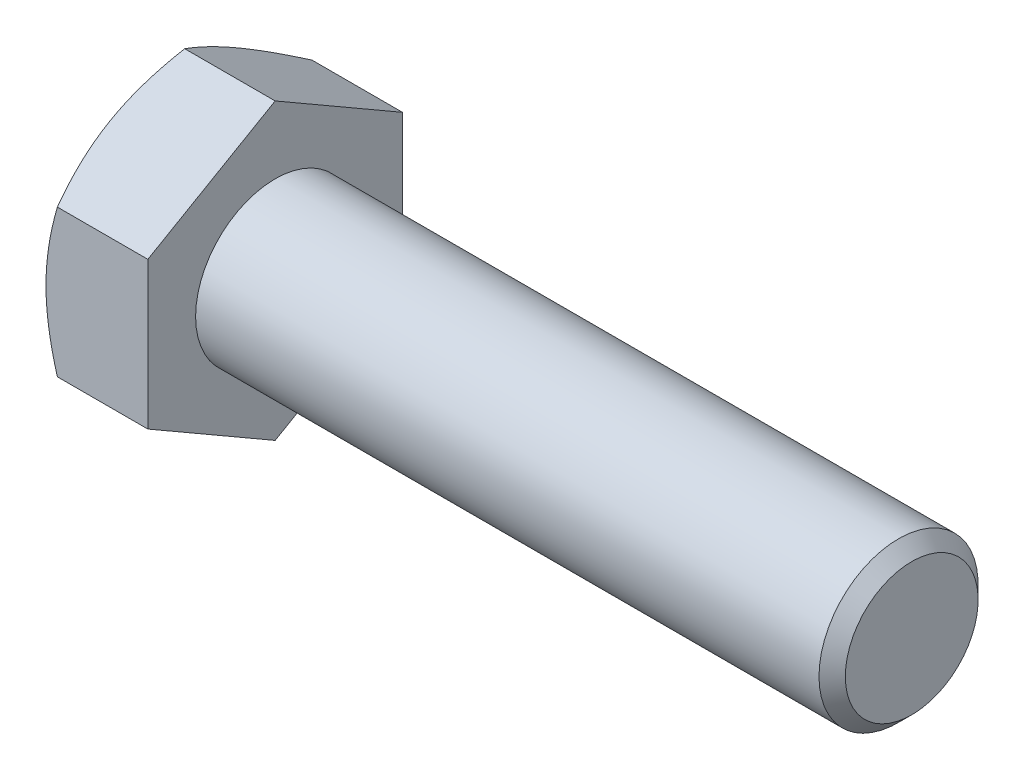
ISO-10303-21;
HEADER;
FILE_DESCRIPTION(('STEP AP214'),'2;1');
FILE_NAME('part.step','',(''),(''),'','','');
FILE_SCHEMA(('AUTOMOTIVE_DESIGN { 1 0 10303 214 1 1 1 1 }'));
ENDSEC;
DATA;
#1=APPLICATION_CONTEXT('core data for automotive mechanical design processes');
#2=APPLICATION_PROTOCOL_DEFINITION('international standard','automotive_design',2000,#1);
#3=PRODUCT_CONTEXT('',#1,'mechanical');
#4=PRODUCT('Part','Part','',(#3));
#5=PRODUCT_RELATED_PRODUCT_CATEGORY('part','',(#4));
#6=PRODUCT_DEFINITION_FORMATION('','',#4);
#7=PRODUCT_DEFINITION_CONTEXT('part definition',#1,'design');
#8=PRODUCT_DEFINITION('design','',#6,#7);
#9=PRODUCT_DEFINITION_SHAPE('','',#8);
#10=(LENGTH_UNIT() NAMED_UNIT(*) SI_UNIT(.MILLI.,.METRE.));
#11=(NAMED_UNIT(*) PLANE_ANGLE_UNIT() SI_UNIT($,.RADIAN.));
#12=(NAMED_UNIT(*) SI_UNIT($,.STERADIAN.) SOLID_ANGLE_UNIT());
#13=UNCERTAINTY_MEASURE_WITH_UNIT(LENGTH_MEASURE(1.E-05),#10,'distance_accuracy_value','');
#14=(GEOMETRIC_REPRESENTATION_CONTEXT(3) GLOBAL_UNCERTAINTY_ASSIGNED_CONTEXT((#13)) GLOBAL_UNIT_ASSIGNED_CONTEXT((#10,
#11,#12)) REPRESENTATION_CONTEXT('',''));
#15=CARTESIAN_POINT('',(0.,0.,0.));
#16=DIRECTION('',(0.,0.,1.));
#17=DIRECTION('',(1.,0.,0.));
#18=AXIS2_PLACEMENT_3D('',#15,#16,#17);
#19=CARTESIAN_POINT('',(6.4,4.618802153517,-8.));
#20=DIRECTION('',(0.,-0.866025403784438,0.500000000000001));
#21=DIRECTION('',(0.,-0.500000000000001,-0.866025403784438));
#22=AXIS2_PLACEMENT_3D('',#19,#20,#21);
#23=PLANE('',#22);
#24=CARTESIAN_POINT('',(0.714597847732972,9.23771977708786,0.0002));
#25=CARTESIAN_POINT('',(0.655990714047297,9.13619343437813,-0.175648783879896));
#26=CARTESIAN_POINT('',(0.60004340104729,9.03428856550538,-0.352153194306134));
#27=CARTESIAN_POINT('',(0.494201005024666,8.82965122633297,-0.706595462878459));
#28=CARTESIAN_POINT('',(0.444308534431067,8.72691841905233,-0.884533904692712));
#29=CARTESIAN_POINT('',(0.304692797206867,8.41707512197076,-1.42119823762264));
#30=CARTESIAN_POINT('',(0.225281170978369,8.20874154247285,-1.78204258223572));
#31=CARTESIAN_POINT('',(0.132161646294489,7.89697436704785,-2.32203917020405));
#32=CARTESIAN_POINT('',(0.105634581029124,7.79447216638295,-2.49957818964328));
#33=CARTESIAN_POINT('',(0.0611531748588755,7.58900421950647,-2.8554591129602));
#34=CARTESIAN_POINT('',(0.0431980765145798,7.4860385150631,-3.03380094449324));
#35=CARTESIAN_POINT('',(0.0163156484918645,7.27992981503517,-3.39079168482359));
#36=CARTESIAN_POINT('',(0.00737807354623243,7.17678715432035,-3.5694400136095));
#37=CARTESIAN_POINT('',(-0.00127769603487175,6.97040655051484,-3.92690170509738));
#38=CARTESIAN_POINT('',(-0.000996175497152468,6.86716861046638,-4.10571506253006));
#39=CARTESIAN_POINT('',(0.00814502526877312,6.67416139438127,-4.4400133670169));
#40=CARTESIAN_POINT('',(0.0158896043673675,6.58437849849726,-4.59552190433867));
#41=CARTESIAN_POINT('',(0.0382011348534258,6.40502298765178,-4.90617476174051));
#42=CARTESIAN_POINT('',(0.0527685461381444,6.31545038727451,-5.06131905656));
#43=CARTESIAN_POINT('',(0.106360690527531,6.04707935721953,-5.52615131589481));
#44=CARTESIAN_POINT('',(0.155268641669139,5.86875596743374,-5.83501648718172));
#45=CARTESIAN_POINT('',(0.277539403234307,5.51021755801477,-6.4560232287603));
#46=CARTESIAN_POINT('',(0.351420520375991,5.3300482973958,-6.76808554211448));
#47=CARTESIAN_POINT('',(0.519100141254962,4.97239658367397,-7.38755648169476));
#48=CARTESIAN_POINT('',(0.612859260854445,4.79490955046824,-7.69497304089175));
#49=CARTESIAN_POINT('',(0.714597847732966,4.61868668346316,-8.0002));
#50=B_SPLINE_CURVE_WITH_KNOTS('',3,(#24,#25,#26,#27,#28,#29,#30,#31,#32,#33,#34,#35,#36,#37,#38,
#39,#40,#41,#42,#43,#44,#45,#46,#47,#48,#49),.UNSPECIFIED.,.F.,.F.,(4,2,2,2,2,2,2,2,2,2,2,2,4),
(0.,0.63397354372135,1.26821965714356,2.53934712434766,3.15934343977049,3.77928496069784,
4.39852133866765,5.01773858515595,5.55680239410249,6.09590254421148,7.17487077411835,
8.27776850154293,9.37850115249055),.UNSPECIFIED.);
#51=CARTESIAN_POINT('',(0.714531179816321,9.23760430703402,0.));
#52=VERTEX_POINT('',#51);
#53=CARTESIAN_POINT('',(0.,6.9282032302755,-4.00000000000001));
#54=VERTEX_POINT('',#53);
#55=EDGE_CURVE('E48',#52,#54,#50,.T.);
#56=ORIENTED_EDGE('',*,*,#55,.F.);
#57=DIRECTION('',(-1.,0.,0.));
#58=VECTOR('',#57,1.);
#59=CARTESIAN_POINT('',(6.4,9.23760430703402,0.));
#60=LINE('',#59,#58);
#61=CARTESIAN_POINT('',(6.4,9.23760430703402,0.));
#62=VERTEX_POINT('',#61);
#63=EDGE_CURVE('E144',#62,#52,#60,.T.);
#64=ORIENTED_EDGE('',*,*,#63,.F.);
#65=DIRECTION('',(0.,0.500000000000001,0.866025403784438));
#66=VECTOR('',#65,1.);
#67=CARTESIAN_POINT('',(6.4,4.618802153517,-8.));
#68=LINE('',#67,#66);
#69=CARTESIAN_POINT('',(6.4,4.618802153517,-8.));
#70=VERTEX_POINT('',#69);
#71=EDGE_CURVE('E235',#70,#62,#68,.T.);
#72=ORIENTED_EDGE('',*,*,#71,.F.);
#73=DIRECTION('',(-1.,0.,0.));
#74=VECTOR('',#73,1.);
#75=CARTESIAN_POINT('',(6.4,4.618802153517,-8.));
#76=LINE('',#75,#74);
#77=CARTESIAN_POINT('',(0.714531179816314,4.618802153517,-8.));
#78=VERTEX_POINT('',#77);
#79=EDGE_CURVE('E132',#70,#78,#76,.T.);
#80=ORIENTED_EDGE('',*,*,#79,.T.);
#81=EDGE_CURVE('E126',#54,#78,#50,.T.);
#82=ORIENTED_EDGE('',*,*,#81,.F.);
#83=EDGE_LOOP('',(#56,#64,#72,#80,#82));
#84=FACE_BOUND('',#83,.T.);
#85=ADVANCED_FACE('F32',(#84),#23,.F.);
#86=CARTESIAN_POINT('',(6.4,9.23760430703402,0.));
#87=DIRECTION('',(0.,-0.866025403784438,-0.500000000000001));
#88=DIRECTION('',(0.,0.500000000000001,-0.866025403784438));
#89=AXIS2_PLACEMENT_3D('',#86,#87,#88);
#90=PLANE('',#89);
#91=CARTESIAN_POINT('',(0.714597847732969,4.61868668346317,8.0002));
#92=CARTESIAN_POINT('',(0.655990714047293,4.72021302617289,7.8243512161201));
#93=CARTESIAN_POINT('',(0.600043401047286,4.82211789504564,7.64784680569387));
#94=CARTESIAN_POINT('',(0.494201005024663,5.02675523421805,7.29340453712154));
#95=CARTESIAN_POINT('',(0.444308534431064,5.12948804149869,7.11546609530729));
#96=CARTESIAN_POINT('',(0.304692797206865,5.43933133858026,6.57880176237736));
#97=CARTESIAN_POINT('',(0.225281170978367,5.64766491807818,6.21795741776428));
#98=CARTESIAN_POINT('',(0.132161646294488,5.95943209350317,5.67796082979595));
#99=CARTESIAN_POINT('',(0.105634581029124,6.06193429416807,5.50042181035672));
#100=CARTESIAN_POINT('',(0.0611531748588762,6.26740224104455,5.1445408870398));
#101=CARTESIAN_POINT('',(0.0431980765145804,6.37036794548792,4.96619905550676));
#102=CARTESIAN_POINT('',(0.0163156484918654,6.57647664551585,4.60920831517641));
#103=CARTESIAN_POINT('',(0.0073780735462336,6.67961930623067,4.4305599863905));
#104=CARTESIAN_POINT('',(-0.0012776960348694,6.88599991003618,4.07309829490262));
#105=CARTESIAN_POINT('',(-0.00099617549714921,6.98923785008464,3.89428493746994));
#106=CARTESIAN_POINT('',(0.0081450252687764,7.18224506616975,3.5599866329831));
#107=CARTESIAN_POINT('',(0.0158896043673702,7.27202796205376,3.40447809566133));
#108=CARTESIAN_POINT('',(0.0382011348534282,7.45138347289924,3.09382523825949));
#109=CARTESIAN_POINT('',(0.0527685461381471,7.54095607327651,2.93868094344));
#110=CARTESIAN_POINT('',(0.106360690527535,7.80932710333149,2.47384868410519));
#111=CARTESIAN_POINT('',(0.155268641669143,7.98765049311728,2.16498351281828));
#112=CARTESIAN_POINT('',(0.277539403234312,8.34618890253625,1.5439767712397));
#113=CARTESIAN_POINT('',(0.351420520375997,8.52635816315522,1.23191445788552));
#114=CARTESIAN_POINT('',(0.519100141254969,8.88400987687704,0.612443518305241));
#115=CARTESIAN_POINT('',(0.612859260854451,9.06149691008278,0.305026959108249));
#116=CARTESIAN_POINT('',(0.714597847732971,9.23771977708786,-0.000200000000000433));
#117=B_SPLINE_CURVE_WITH_KNOTS('',3,(#91,#92,#93,#94,#95,#96,#97,#98,#99,#100,#101,#102,#103,
#104,#105,#106,#107,#108,#109,#110,#111,#112,#113,#114,#115,#116),.UNSPECIFIED.,.F.,.F.,(4,2,2,
2,2,2,2,2,2,2,2,2,4),(0.,0.63397354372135,1.26821965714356,2.53934712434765,3.15934343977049,
3.77928496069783,4.39852133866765,5.01773858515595,5.55680239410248,6.09590254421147,
7.17487077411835,8.27776850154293,9.37850115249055),.UNSPECIFIED.);
#118=CARTESIAN_POINT('',(0.714531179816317,4.61880215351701,8.));
#119=VERTEX_POINT('',#118);
#120=CARTESIAN_POINT('',(0.,6.92820323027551,4.));
#121=VERTEX_POINT('',#120);
#122=EDGE_CURVE('E55',#119,#121,#117,.T.);
#123=ORIENTED_EDGE('',*,*,#122,.F.);
#124=DIRECTION('',(-1.,0.,0.));
#125=VECTOR('',#124,1.);
#126=CARTESIAN_POINT('',(6.4,4.618802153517,8.));
#127=LINE('',#126,#125);
#128=CARTESIAN_POINT('',(6.4,4.618802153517,8.));
#129=VERTEX_POINT('',#128);
#130=EDGE_CURVE('E142',#129,#119,#127,.T.);
#131=ORIENTED_EDGE('',*,*,#130,.F.);
#132=DIRECTION('',(0.,-0.500000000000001,0.866025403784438));
#133=VECTOR('',#132,1.);
#134=CARTESIAN_POINT('',(6.4,9.23760430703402,0.));
#135=LINE('',#134,#133);
#136=EDGE_CURVE('E233',#62,#129,#135,.T.);
#137=ORIENTED_EDGE('',*,*,#136,.F.);
#138=ORIENTED_EDGE('',*,*,#63,.T.);
#139=EDGE_CURVE('E159',#121,#52,#117,.T.);
#140=ORIENTED_EDGE('',*,*,#139,.F.);
#141=EDGE_LOOP('',(#123,#131,#137,#138,#140));
#142=FACE_BOUND('',#141,.T.);
#143=ADVANCED_FACE('F165',(#142),#90,.F.);
#144=CARTESIAN_POINT('',(6.4,4.618802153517,8.));
#145=DIRECTION('',(0.,0.,-1.));
#146=DIRECTION('',(0.,1.,0.));
#147=AXIS2_PLACEMENT_3D('',#144,#145,#146);
#148=PLANE('',#147);
#149=CARTESIAN_POINT('',(4.02490590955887,-12.6546855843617,8.));
#150=CARTESIAN_POINT('',(3.85338487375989,-12.3031246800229,8.));
#151=CARTESIAN_POINT('',(3.68343819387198,-11.9507829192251,8.));
#152=CARTESIAN_POINT('',(3.34757427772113,-11.2441233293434,8.));
#153=CARTESIAN_POINT('',(3.18165763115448,-10.8898052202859,8.));
#154=CARTESIAN_POINT('',(2.85395194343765,-10.1770689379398,8.));
#155=CARTESIAN_POINT('',(2.69218824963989,-9.81863907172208,8.));
#156=CARTESIAN_POINT('',(2.37495726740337,-9.09901412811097,8.));
#157=CARTESIAN_POINT('',(2.21948969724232,-8.7378191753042,8.));
#158=CARTESIAN_POINT('',(1.91124909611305,-7.99950051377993,8.));
#159=CARTESIAN_POINT('',(1.75875676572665,-7.62225899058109,8.));
#160=CARTESIAN_POINT('',(1.46472411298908,-6.8634557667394,8.));
#161=CARTESIAN_POINT('',(1.32318498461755,-6.48189360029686,8.));
#162=CARTESIAN_POINT('',(1.05459432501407,-5.71447512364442,8.));
#163=CARTESIAN_POINT('',(0.927515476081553,-5.32862847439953,8.));
#164=CARTESIAN_POINT('',(0.691757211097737,-4.55141880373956,8.));
#165=CARTESIAN_POINT('',(0.58307225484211,-4.16005748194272,8.));
#166=CARTESIAN_POINT('',(0.389750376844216,-3.37376378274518,8.));
#167=CARTESIAN_POINT('',(0.304973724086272,-2.97886668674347,8.));
#168=CARTESIAN_POINT('',(0.199275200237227,-2.3827345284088,8.));
#169=CARTESIAN_POINT('',(0.167618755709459,-2.18337977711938,8.));
#170=CARTESIAN_POINT('',(0.112075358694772,-1.78359737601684,8.));
#171=CARTESIAN_POINT('',(0.0881876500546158,-1.58316983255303,8.));
#172=CARTESIAN_POINT('',(0.0489706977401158,-1.18423542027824,8.));
#173=CARTESIAN_POINT('',(0.033529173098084,-0.98573963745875,8.));
#174=CARTESIAN_POINT('',(0.011062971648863,-0.588272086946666,8.));
#175=CARTESIAN_POINT('',(0.00403814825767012,-0.389300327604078,8.));
#176=CARTESIAN_POINT('',(-0.0014258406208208,0.00876221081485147,8.));
#177=CARTESIAN_POINT('',(0.000134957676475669,0.20785298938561,8.));
#178=CARTESIAN_POINT('',(0.0118014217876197,0.605786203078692,8.));
#179=CARTESIAN_POINT('',(0.0219074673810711,0.804628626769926,8.));
#180=CARTESIAN_POINT('',(0.0557165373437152,1.27520491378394,8.));
#181=CARTESIAN_POINT('',(0.0830672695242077,1.54668291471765,8.));
#182=CARTESIAN_POINT('',(0.152259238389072,2.08777092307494,8.));
#183=CARTESIAN_POINT('',(0.194102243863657,2.35738069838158,8.));
#184=CARTESIAN_POINT('',(0.339163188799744,3.16301774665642,8.));
#185=CARTESIAN_POINT('',(0.461891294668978,3.69558688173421,8.));
#186=CARTESIAN_POINT('',(0.676586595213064,4.49226053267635,8.));
#187=CARTESIAN_POINT('',(0.754301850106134,4.76044512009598,8.));
#188=CARTESIAN_POINT('',(0.918275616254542,5.29421544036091,8.));
#189=CARTESIAN_POINT('',(1.00453419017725,5.55980115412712,8.));
#190=CARTESIAN_POINT('',(1.1841720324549,6.08844836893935,8.));
#191=CARTESIAN_POINT('',(1.27754931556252,6.35151055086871,8.));
#192=CARTESIAN_POINT('',(1.47027924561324,6.87542420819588,8.));
#193=CARTESIAN_POINT('',(1.56963178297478,7.13627572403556,8.));
#194=CARTESIAN_POINT('',(1.83061788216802,7.80218874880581,8.));
#195=CARTESIAN_POINT('',(1.99585030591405,8.20583800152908,8.));
#196=CARTESIAN_POINT('',(2.33560643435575,9.00922090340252,8.));
#197=CARTESIAN_POINT('',(2.51013099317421,9.40895418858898,8.));
#198=CARTESIAN_POINT('',(2.86641484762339,10.2053302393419,8.));
#199=CARTESIAN_POINT('',(3.04817649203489,10.6019719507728,8.));
#200=CARTESIAN_POINT('',(3.41731474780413,11.3926098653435,8.));
#201=CARTESIAN_POINT('',(3.60469117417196,11.7866061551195,8.));
#202=CARTESIAN_POINT('',(3.98417976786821,12.5730081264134,8.));
#203=CARTESIAN_POINT('',(4.17629837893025,12.9654106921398,8.));
#204=CARTESIAN_POINT('',(4.56413460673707,13.7484335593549,8.));
#205=CARTESIAN_POINT('',(4.75985224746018,14.1390538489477,8.));
#206=CARTESIAN_POINT('',(5.15417790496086,14.91873869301,8.));
#207=CARTESIAN_POINT('',(5.35278537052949,15.3078035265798,8.));
#208=CARTESIAN_POINT('',(5.75241277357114,16.0846929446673,8.));
#209=CARTESIAN_POINT('',(5.9534327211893,16.4725175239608,8.));
#210=CARTESIAN_POINT('',(6.5202315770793,17.5591699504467,8.));
#211=CARTESIAN_POINT('',(6.88826669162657,18.2568207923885,8.));
#212=CARTESIAN_POINT('',(7.62911645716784,19.6496204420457,8.));
#213=CARTESIAN_POINT('',(8.00193135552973,20.3447691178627,8.));
#214=CARTESIAN_POINT('',(8.74998840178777,21.730949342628,8.));
#215=CARTESIAN_POINT('',(9.12521929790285,22.4219869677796,8.));
#216=CARTESIAN_POINT('',(9.69012625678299,23.4573861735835,8.));
#217=CARTESIAN_POINT('',(9.87876537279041,23.8023143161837,8.));
#218=CARTESIAN_POINT('',(10.2566598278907,24.4918321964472,8.));
#219=CARTESIAN_POINT('',(10.4459151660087,24.8364219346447,8.));
#220=CARTESIAN_POINT('',(10.635441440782,25.1808626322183,8.));
#221=B_SPLINE_CURVE_WITH_KNOTS('',3,(#149,#150,#151,#152,#153,#154,#155,#156,#157,#158,#159,
#160,#161,#162,#163,#164,#165,#166,#167,#168,#169,#170,#171,#172,#173,#174,#175,#176,#177,#178,
#179,#180,#181,#182,#183,#184,#185,#186,#187,#188,#189,#190,#191,#192,#193,#194,#195,#196,#197,
#198,#199,#200,#201,#202,#203,#204,#205,#206,#207,#208,#209,#210,#211,#212,#213,#214,#215,#216,
#217,#218,#219,#220),.UNSPECIFIED.,.F.,.F.,(4,2,2,2,2,2,2,2,2,2,2,2,2,2,2,2,2,2,2,2,2,2,2,2,2,2,
2,2,2,2,2,2,2,2,2,4),(0.,1.17352534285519,2.34722138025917,3.52689945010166,4.70652467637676,
5.92708317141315,7.14777452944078,8.36612012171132,9.58409809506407,10.7948027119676,
11.4002329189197,12.0056041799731,12.6027191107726,13.199823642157,13.7969256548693,
14.3940542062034,15.2121538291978,16.030353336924,17.6675489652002,18.5051258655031,
19.3427089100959,20.1800592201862,21.0173941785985,22.3257038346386,23.6341339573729,
24.9429922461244,26.2518074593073,27.5625113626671,28.8732240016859,30.1836898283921,
31.4941611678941,33.8604585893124,36.2268789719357,38.5858914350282,39.7653150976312,
40.9447368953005),.UNSPECIFIED.);
#222=CARTESIAN_POINT('',(0.714531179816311,-4.61880215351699,8.));
#223=VERTEX_POINT('',#222);
#224=CARTESIAN_POINT('',(0.,0.,8.));
#225=VERTEX_POINT('',#224);
#226=EDGE_CURVE('E245',#223,#225,#221,.T.);
#227=ORIENTED_EDGE('',*,*,#226,.F.);
#228=DIRECTION('',(-1.,0.,0.));
#229=VECTOR('',#228,1.);
#230=CARTESIAN_POINT('',(6.4,-4.61880215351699,8.));
#231=LINE('',#230,#229);
#232=CARTESIAN_POINT('',(6.4,-4.61880215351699,8.));
#233=VERTEX_POINT('',#232);
#234=EDGE_CURVE('E134',#233,#223,#231,.T.);
#235=ORIENTED_EDGE('',*,*,#234,.F.);
#236=DIRECTION('',(0.,-1.,0.));
#237=VECTOR('',#236,1.);
#238=CARTESIAN_POINT('',(6.4,4.618802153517,8.));
#239=LINE('',#238,#237);
#240=EDGE_CURVE('E229',#129,#233,#239,.T.);
#241=ORIENTED_EDGE('',*,*,#240,.F.);
#242=ORIENTED_EDGE('',*,*,#130,.T.);
#243=EDGE_CURVE('E183',#225,#119,#221,.T.);
#244=ORIENTED_EDGE('',*,*,#243,.F.);
#245=EDGE_LOOP('',(#227,#235,#241,#242,#244));
#246=FACE_BOUND('',#245,.T.);
#247=ADVANCED_FACE('F251',(#246),#148,.F.);
#248=CARTESIAN_POINT('',(6.4,-9.23760430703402,0.));
#249=DIRECTION('',(0.,0.866025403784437,-0.500000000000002));
#250=DIRECTION('',(0.,0.500000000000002,0.866025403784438));
#251=AXIS2_PLACEMENT_3D('',#248,#249,#250);
#252=PLANE('',#251);
#253=CARTESIAN_POINT('',(0.71459784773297,-9.23771977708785,-0.000200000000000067));
#254=CARTESIAN_POINT('',(0.655990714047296,-9.13619343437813,0.175648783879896));
#255=CARTESIAN_POINT('',(0.600043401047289,-9.03428856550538,0.352153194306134));
#256=CARTESIAN_POINT('',(0.494201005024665,-8.82965122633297,0.706595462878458));
#257=CARTESIAN_POINT('',(0.444308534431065,-8.72691841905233,0.88453390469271));
#258=CARTESIAN_POINT('',(0.304692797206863,-8.41707512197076,1.42119823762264));
#259=CARTESIAN_POINT('',(0.225281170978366,-8.20874154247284,1.78204258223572));
#260=CARTESIAN_POINT('',(0.132161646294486,-7.89697436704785,2.32203917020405));
#261=CARTESIAN_POINT('',(0.105634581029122,-7.79447216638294,2.49957818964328));
#262=CARTESIAN_POINT('',(0.0611531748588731,-7.58900421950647,2.85545911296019));
#263=CARTESIAN_POINT('',(0.043198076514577,-7.4860385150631,3.03380094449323));
#264=CARTESIAN_POINT('',(0.0163156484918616,-7.27992981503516,3.39079168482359));
#265=CARTESIAN_POINT('',(0.00737807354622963,-7.17678715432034,3.5694400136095));
#266=CARTESIAN_POINT('',(-0.00127769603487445,-6.97040655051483,3.92690170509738));
#267=CARTESIAN_POINT('',(-0.00099617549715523,-6.86716861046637,4.10571506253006));
#268=CARTESIAN_POINT('',(0.00814502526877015,-6.67416139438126,4.4400133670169));
#269=CARTESIAN_POINT('',(0.0158896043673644,-6.58437849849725,4.59552190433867));
#270=CARTESIAN_POINT('',(0.0382011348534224,-6.40502298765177,4.9061747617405));
#271=CARTESIAN_POINT('',(0.0527685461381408,-6.31545038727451,5.06131905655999));
#272=CARTESIAN_POINT('',(0.106360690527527,-6.04707935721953,5.52615131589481));
#273=CARTESIAN_POINT('',(0.155268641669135,-5.86875596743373,5.83501648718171));
#274=CARTESIAN_POINT('',(0.277539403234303,-5.51021755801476,6.45602322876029));
#275=CARTESIAN_POINT('',(0.351420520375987,-5.33004829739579,6.76808554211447));
#276=CARTESIAN_POINT('',(0.519100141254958,-4.97239658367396,7.38755648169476));
#277=CARTESIAN_POINT('',(0.612859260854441,-4.79490955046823,7.69497304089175));
#278=CARTESIAN_POINT('',(0.714597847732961,-4.61868668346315,8.0002));
#279=B_SPLINE_CURVE_WITH_KNOTS('',3,(#253,#254,#255,#256,#257,#258,#259,#260,#261,#262,#263,
#264,#265,#266,#267,#268,#269,#270,#271,#272,#273,#274,#275,#276,#277,#278),.UNSPECIFIED.,.F.,
.F.,(4,2,2,2,2,2,2,2,2,2,2,2,4),(0.,0.63397354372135,1.26821965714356,2.53934712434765,
3.15934343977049,3.77928496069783,4.39852133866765,5.01773858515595,5.55680239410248,
6.09590254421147,7.17487077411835,8.27776850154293,9.37850115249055),.UNSPECIFIED.);
#280=CARTESIAN_POINT('',(0.714531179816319,-9.23760430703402,0.));
#281=VERTEX_POINT('',#280);
#282=CARTESIAN_POINT('',(0.,-6.9282032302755,4.00000000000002));
#283=VERTEX_POINT('',#282);
#284=EDGE_CURVE('E167',#281,#283,#279,.T.);
#285=ORIENTED_EDGE('',*,*,#284,.F.);
#286=DIRECTION('',(-1.,0.,0.));
#287=VECTOR('',#286,1.);
#288=CARTESIAN_POINT('',(6.4,-9.23760430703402,0.));
#289=LINE('',#288,#287);
#290=CARTESIAN_POINT('',(6.4,-9.23760430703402,0.));
#291=VERTEX_POINT('',#290);
#292=EDGE_CURVE('E131',#291,#281,#289,.T.);
#293=ORIENTED_EDGE('',*,*,#292,.F.);
#294=DIRECTION('',(0.,-0.500000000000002,-0.866025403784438));
#295=VECTOR('',#294,1.);
#296=CARTESIAN_POINT('',(6.4,-9.23760430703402,0.));
#297=LINE('',#296,#295);
#298=EDGE_CURVE('E227',#233,#291,#297,.T.);
#299=ORIENTED_EDGE('',*,*,#298,.F.);
#300=ORIENTED_EDGE('',*,*,#234,.T.);
#301=EDGE_CURVE('E169',#283,#223,#279,.T.);
#302=ORIENTED_EDGE('',*,*,#301,.F.);
#303=EDGE_LOOP('',(#285,#293,#299,#300,#302));
#304=FACE_BOUND('',#303,.T.);
#305=ADVANCED_FACE('F223',(#304),#252,.F.);
#306=CARTESIAN_POINT('',(6.4,-4.61880215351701,-8.));
#307=DIRECTION('',(0.,0.866025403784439,0.5));
#308=DIRECTION('',(0.,-0.5,0.866025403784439));
#309=AXIS2_PLACEMENT_3D('',#306,#307,#308);
#310=PLANE('',#309);
#311=CARTESIAN_POINT('',(0.714597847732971,-4.61868668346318,-8.0002));
#312=CARTESIAN_POINT('',(0.655990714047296,-4.7202130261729,-7.8243512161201));
#313=CARTESIAN_POINT('',(0.600043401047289,-4.82211789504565,-7.64784680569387));
#314=CARTESIAN_POINT('',(0.494201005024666,-5.02675523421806,-7.29340453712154));
#315=CARTESIAN_POINT('',(0.444308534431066,-5.1294880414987,-7.11546609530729));
#316=CARTESIAN_POINT('',(0.304692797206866,-5.43933133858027,-6.57880176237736));
#317=CARTESIAN_POINT('',(0.22528117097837,-5.64766491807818,-6.21795741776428));
#318=CARTESIAN_POINT('',(0.13216164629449,-5.95943209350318,-5.67796082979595));
#319=CARTESIAN_POINT('',(0.105634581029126,-6.06193429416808,-5.50042181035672));
#320=CARTESIAN_POINT('',(0.0611531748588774,-6.26740224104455,-5.1445408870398));
#321=CARTESIAN_POINT('',(0.0431980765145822,-6.37036794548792,-4.96619905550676));
#322=CARTESIAN_POINT('',(0.0163156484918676,-6.57647664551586,-4.60920831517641));
#323=CARTESIAN_POINT('',(0.00737807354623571,-6.67961930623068,-4.4305599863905));
#324=CARTESIAN_POINT('',(-0.001277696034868,-6.88599991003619,-4.07309829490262));
#325=CARTESIAN_POINT('',(-0.00099617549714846,-6.98923785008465,-3.89428493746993));
#326=CARTESIAN_POINT('',(0.00814502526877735,-7.18224506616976,-3.5599866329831));
#327=CARTESIAN_POINT('',(0.0158896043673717,-7.27202796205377,-3.40447809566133));
#328=CARTESIAN_POINT('',(0.0382011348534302,-7.45138347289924,-3.09382523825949));
#329=CARTESIAN_POINT('',(0.0527685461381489,-7.54095607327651,-2.93868094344));
#330=CARTESIAN_POINT('',(0.106360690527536,-7.80932710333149,-2.47384868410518));
#331=CARTESIAN_POINT('',(0.155268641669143,-7.98765049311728,-2.16498351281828));
#332=CARTESIAN_POINT('',(0.277539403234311,-8.34618890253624,-1.5439767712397));
#333=CARTESIAN_POINT('',(0.351420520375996,-8.52635816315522,-1.23191445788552));
#334=CARTESIAN_POINT('',(0.519100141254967,-8.88400987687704,-0.612443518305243));
#335=CARTESIAN_POINT('',(0.61285926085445,-9.06149691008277,-0.305026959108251));
#336=CARTESIAN_POINT('',(0.714597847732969,-9.23771977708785,0.000199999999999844));
#337=B_SPLINE_CURVE_WITH_KNOTS('',3,(#311,#312,#313,#314,#315,#316,#317,#318,#319,#320,#321,
#322,#323,#324,#325,#326,#327,#328,#329,#330,#331,#332,#333,#334,#335,#336),.UNSPECIFIED.,.F.,
.F.,(4,2,2,2,2,2,2,2,2,2,2,2,4),(0.,0.633973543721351,1.26821965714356,2.53934712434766,
3.15934343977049,3.77928496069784,4.39852133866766,5.01773858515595,5.55680239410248,
6.09590254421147,7.17487077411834,8.27776850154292,9.37850115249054),.UNSPECIFIED.);
#338=CARTESIAN_POINT('',(0.714531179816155,-4.61880215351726,-8.));
#339=VERTEX_POINT('',#338);
#340=CARTESIAN_POINT('',(0.,-6.92820323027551,-4.));
#341=VERTEX_POINT('',#340);
#342=EDGE_CURVE('E108',#339,#341,#337,.T.);
#343=ORIENTED_EDGE('',*,*,#342,.F.);
#344=DIRECTION('',(-1.,0.,0.));
#345=VECTOR('',#344,1.);
#346=CARTESIAN_POINT('',(6.4,-4.61880215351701,-8.));
#347=LINE('',#346,#345);
#348=CARTESIAN_POINT('',(6.4,-4.61880215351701,-8.));
#349=VERTEX_POINT('',#348);
#350=EDGE_CURVE('E122',#349,#339,#347,.T.);
#351=ORIENTED_EDGE('',*,*,#350,.F.);
#352=DIRECTION('',(0.,0.5,-0.866025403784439));
#353=VECTOR('',#352,1.);
#354=CARTESIAN_POINT('',(6.4,-4.61880215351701,-8.));
#355=LINE('',#354,#353);
#356=EDGE_CURVE('E225',#291,#349,#355,.T.);
#357=ORIENTED_EDGE('',*,*,#356,.F.);
#358=ORIENTED_EDGE('',*,*,#292,.T.);
#359=EDGE_CURVE('E125',#341,#281,#337,.T.);
#360=ORIENTED_EDGE('',*,*,#359,.F.);
#361=EDGE_LOOP('',(#343,#351,#357,#358,#360));
#362=FACE_BOUND('',#361,.T.);
#363=ADVANCED_FACE('F120',(#362),#310,.F.);
#364=CARTESIAN_POINT('',(6.4,4.618802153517,-8.));
#365=DIRECTION('',(0.,0.,1.));
#366=DIRECTION('',(1.,0.,0.));
#367=AXIS2_PLACEMENT_3D('',#364,#365,#366);
#368=PLANE('',#367);
#369=CARTESIAN_POINT('',(4.02490590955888,-12.6546855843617,-8.));
#370=CARTESIAN_POINT('',(3.8533848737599,-12.3031246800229,-8.));
#371=CARTESIAN_POINT('',(3.683438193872,-11.9507829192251,-8.));
#372=CARTESIAN_POINT('',(3.34757427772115,-11.2441233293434,-8.));
#373=CARTESIAN_POINT('',(3.18165763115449,-10.889805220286,-8.));
#374=CARTESIAN_POINT('',(2.85395194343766,-10.1770689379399,-8.));
#375=CARTESIAN_POINT('',(2.6921882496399,-9.81863907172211,-8.));
#376=CARTESIAN_POINT('',(2.37495726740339,-9.099014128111,-8.));
#377=CARTESIAN_POINT('',(2.21948969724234,-8.73781917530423,-8.));
#378=CARTESIAN_POINT('',(1.91124909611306,-7.99950051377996,-8.));
#379=CARTESIAN_POINT('',(1.75875676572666,-7.62225899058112,-8.));
#380=CARTESIAN_POINT('',(1.46472411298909,-6.86345576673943,-8.));
#381=CARTESIAN_POINT('',(1.32318498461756,-6.48189360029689,-8.));
#382=CARTESIAN_POINT('',(1.05459432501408,-5.71447512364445,-8.));
#383=CARTESIAN_POINT('',(0.927515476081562,-5.32862847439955,-8.));
#384=CARTESIAN_POINT('',(0.691757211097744,-4.55141880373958,-8.));
#385=CARTESIAN_POINT('',(0.583072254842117,-4.16005748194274,-8.));
#386=CARTESIAN_POINT('',(0.389750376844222,-3.3737637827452,-8.));
#387=CARTESIAN_POINT('',(0.304973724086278,-2.97886668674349,-8.));
#388=CARTESIAN_POINT('',(0.199275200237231,-2.38273452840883,-8.));
#389=CARTESIAN_POINT('',(0.167618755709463,-2.1833797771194,-8.));
#390=CARTESIAN_POINT('',(0.112075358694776,-1.78359737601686,-8.));
#391=CARTESIAN_POINT('',(0.0881876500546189,-1.58316983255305,-8.));
#392=CARTESIAN_POINT('',(0.0489706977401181,-1.18423542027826,-8.));
#393=CARTESIAN_POINT('',(0.0335291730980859,-0.985739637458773,-8.));
#394=CARTESIAN_POINT('',(0.0110629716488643,-0.588272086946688,-8.));
#395=CARTESIAN_POINT('',(0.00403814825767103,-0.3893003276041,-8.));
#396=CARTESIAN_POINT('',(-0.00142584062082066,0.00876221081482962,-8.));
#397=CARTESIAN_POINT('',(0.000134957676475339,0.207852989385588,-8.));
#398=CARTESIAN_POINT('',(0.011801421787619,0.60578620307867,-8.));
#399=CARTESIAN_POINT('',(0.0219074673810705,0.804628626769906,-8.));
#400=CARTESIAN_POINT('',(0.0557165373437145,1.27520491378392,-8.));
#401=CARTESIAN_POINT('',(0.0830672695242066,1.54668291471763,-8.));
#402=CARTESIAN_POINT('',(0.152259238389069,2.08777092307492,-8.));
#403=CARTESIAN_POINT('',(0.194102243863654,2.35738069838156,-8.));
#404=CARTESIAN_POINT('',(0.339163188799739,3.1630177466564,-8.));
#405=CARTESIAN_POINT('',(0.461891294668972,3.69558688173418,-8.));
#406=CARTESIAN_POINT('',(0.676586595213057,4.49226053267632,-8.));
#407=CARTESIAN_POINT('',(0.754301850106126,4.76044512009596,-8.));
#408=CARTESIAN_POINT('',(0.918275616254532,5.29421544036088,-8.));
#409=CARTESIAN_POINT('',(1.00453419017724,5.55980115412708,-8.));
#410=CARTESIAN_POINT('',(1.18417203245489,6.08844836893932,-8.));
#411=CARTESIAN_POINT('',(1.27754931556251,6.35151055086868,-8.));
#412=CARTESIAN_POINT('',(1.47027924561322,6.87542420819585,-8.));
#413=CARTESIAN_POINT('',(1.56963178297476,7.13627572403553,-8.));
#414=CARTESIAN_POINT('',(1.83061788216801,7.80218874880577,-8.));
#415=CARTESIAN_POINT('',(1.99585030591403,8.20583800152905,-8.));
#416=CARTESIAN_POINT('',(2.33560643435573,9.00922090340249,-8.));
#417=CARTESIAN_POINT('',(2.5101309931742,9.40895418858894,-8.));
#418=CARTESIAN_POINT('',(2.86641484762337,10.2053302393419,-8.));
#419=CARTESIAN_POINT('',(3.04817649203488,10.6019719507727,-8.));
#420=CARTESIAN_POINT('',(3.41731474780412,11.3926098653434,-8.));
#421=CARTESIAN_POINT('',(3.60469117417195,11.7866061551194,-8.));
#422=CARTESIAN_POINT('',(3.98417976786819,12.5730081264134,-8.));
#423=CARTESIAN_POINT('',(4.17629837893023,12.9654106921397,-8.));
#424=CARTESIAN_POINT('',(4.56413460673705,13.7484335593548,-8.));
#425=CARTESIAN_POINT('',(4.75985224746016,14.1390538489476,-8.));
#426=CARTESIAN_POINT('',(5.15417790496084,14.91873869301,-8.));
#427=CARTESIAN_POINT('',(5.35278537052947,15.3078035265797,-8.));
#428=CARTESIAN_POINT('',(5.75241277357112,16.0846929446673,-8.));
#429=CARTESIAN_POINT('',(5.95343272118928,16.4725175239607,-8.));
#430=CARTESIAN_POINT('',(6.52023157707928,17.5591699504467,-8.));
#431=CARTESIAN_POINT('',(6.88826669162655,18.2568207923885,-8.));
#432=CARTESIAN_POINT('',(7.62911645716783,19.6496204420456,-8.));
#433=CARTESIAN_POINT('',(8.00193135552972,20.3447691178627,-8.));
#434=CARTESIAN_POINT('',(8.74998840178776,21.730949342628,-8.));
#435=CARTESIAN_POINT('',(9.12521929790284,22.4219869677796,-8.));
#436=CARTESIAN_POINT('',(9.69012625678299,23.4573861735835,-8.));
#437=CARTESIAN_POINT('',(9.87876537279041,23.8023143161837,-8.));
#438=CARTESIAN_POINT('',(10.2566598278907,24.4918321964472,-8.));
#439=CARTESIAN_POINT('',(10.4459151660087,24.8364219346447,-8.));
#440=CARTESIAN_POINT('',(10.635441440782,25.1808626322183,-8.));
#441=B_SPLINE_CURVE_WITH_KNOTS('',3,(#369,#370,#371,#372,#373,#374,#375,#376,#377,#378,#379,
#380,#381,#382,#383,#384,#385,#386,#387,#388,#389,#390,#391,#392,#393,#394,#395,#396,#397,#398,
#399,#400,#401,#402,#403,#404,#405,#406,#407,#408,#409,#410,#411,#412,#413,#414,#415,#416,#417,
#418,#419,#420,#421,#422,#423,#424,#425,#426,#427,#428,#429,#430,#431,#432,#433,#434,#435,#436,
#437,#438,#439,#440),.UNSPECIFIED.,.F.,.F.,(4,2,2,2,2,2,2,2,2,2,2,2,2,2,2,2,2,2,2,2,2,2,2,2,2,2,
2,2,2,2,2,2,2,2,2,4),(0.,1.1735253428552,2.34722138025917,3.52689945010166,4.70652467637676,
5.92708317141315,7.14777452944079,8.36612012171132,9.58409809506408,10.7948027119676,
11.4002329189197,12.0056041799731,12.6027191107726,13.199823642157,13.7969256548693,
14.3940542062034,15.2121538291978,16.0303533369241,17.6675489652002,18.5051258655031,
19.3427089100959,20.1800592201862,21.0173941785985,22.3257038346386,23.6341339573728,
24.9429922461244,26.2518074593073,27.5625113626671,28.8732240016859,30.1836898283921,
31.4941611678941,33.8604585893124,36.2268789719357,38.5858914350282,39.7653150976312,
40.9447368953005),.UNSPECIFIED.);
#442=CARTESIAN_POINT('',(0.,0.,-8.));
#443=VERTEX_POINT('',#442);
#444=EDGE_CURVE('E114',#78,#443,#441,.F.);
#445=ORIENTED_EDGE('',*,*,#444,.F.);
#446=ORIENTED_EDGE('',*,*,#79,.F.);
#447=DIRECTION('',(0.,1.,0.));
#448=VECTOR('',#447,1.);
#449=CARTESIAN_POINT('',(6.4,4.618802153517,-8.));
#450=LINE('',#449,#448);
#451=EDGE_CURVE('E130',#349,#70,#450,.T.);
#452=ORIENTED_EDGE('',*,*,#451,.F.);
#453=ORIENTED_EDGE('',*,*,#350,.T.);
#454=EDGE_CURVE('E105',#443,#339,#441,.F.);
#455=ORIENTED_EDGE('',*,*,#454,.F.);
#456=EDGE_LOOP('',(#445,#446,#452,#453,#455));
#457=FACE_BOUND('',#456,.T.);
#458=ADVANCED_FACE('F128',(#457),#368,.F.);
#459=CARTESIAN_POINT('',(6.4,9.23760430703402,0.));
#460=DIRECTION('',(1.,0.,0.));
#461=DIRECTION('',(0.,0.,-1.));
#462=AXIS2_PLACEMENT_3D('',#459,#460,#461);
#463=PLANE('',#462);
#464=ORIENTED_EDGE('',*,*,#71,.T.);
#465=ORIENTED_EDGE('',*,*,#136,.T.);
#466=ORIENTED_EDGE('',*,*,#240,.T.);
#467=ORIENTED_EDGE('',*,*,#298,.T.);
#468=ORIENTED_EDGE('',*,*,#356,.T.);
#469=ORIENTED_EDGE('',*,*,#451,.T.);
#470=EDGE_LOOP('',(#464,#465,#466,#467,#468,#469));
#471=FACE_BOUND('',#470,.T.);
#472=CARTESIAN_POINT('',(6.4,0.,0.));
#473=DIRECTION('',(1.,0.,0.));
#474=DIRECTION('',(0.,0.,-1.));
#475=AXIS2_PLACEMENT_3D('',#472,#473,#474);
#476=CIRCLE('',#475,5.);
#477=CARTESIAN_POINT('',(6.4,0.,-5.));
#478=VERTEX_POINT('',#477);
#479=EDGE_CURVE('E238',#478,#478,#476,.F.);
#480=ORIENTED_EDGE('',*,*,#479,.T.);
#481=EDGE_LOOP('',(#480));
#482=FACE_BOUND('',#481,.T.);
#483=ADVANCED_FACE('F253',(#471,#482),#463,.T.);
#484=CARTESIAN_POINT('',(0.,0.,0.));
#485=DIRECTION('',(-1.,0.,0.));
#486=DIRECTION('',(0.,0.,1.));
#487=AXIS2_PLACEMENT_3D('',#484,#485,#486);
#488=CYLINDRICAL_SURFACE('',#487,5.);
#489=ORIENTED_EDGE('',*,*,#479,.F.);
#490=EDGE_LOOP('',(#489));
#491=FACE_BOUND('',#490,.T.);
#492=CARTESIAN_POINT('',(45.572,0.,0.));
#493=DIRECTION('',(-1.,0.,0.));
#494=DIRECTION('',(0.,0.,1.));
#495=AXIS2_PLACEMENT_3D('',#492,#493,#494);
#496=CIRCLE('',#495,5.);
#497=CARTESIAN_POINT('',(45.572,0.,5.));
#498=VERTEX_POINT('',#497);
#499=EDGE_CURVE('E241',#498,#498,#496,.T.);
#500=ORIENTED_EDGE('',*,*,#499,.T.);
#501=EDGE_LOOP('',(#500));
#502=FACE_BOUND('',#501,.T.);
#503=ADVANCED_FACE('F285',(#491,#502),#488,.T.);
#504=CARTESIAN_POINT('',(46.4,0.,0.));
#505=DIRECTION('',(-1.,0.,0.));
#506=DIRECTION('',(0.,0.,1.));
#507=AXIS2_PLACEMENT_3D('',#504,#505,#506);
#508=CONICAL_SURFACE('',#507,4.172,0.785398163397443);
#509=ORIENTED_EDGE('',*,*,#499,.F.);
#510=EDGE_LOOP('',(#509));
#511=FACE_BOUND('',#510,.T.);
#512=CARTESIAN_POINT('',(46.4,0.,0.));
#513=DIRECTION('',(-1.,0.,0.));
#514=DIRECTION('',(0.,0.,1.));
#515=AXIS2_PLACEMENT_3D('',#512,#513,#514);
#516=CIRCLE('',#515,4.172);
#517=CARTESIAN_POINT('',(46.4,0.,4.172));
#518=VERTEX_POINT('',#517);
#519=EDGE_CURVE('E243',#518,#518,#516,.T.);
#520=ORIENTED_EDGE('',*,*,#519,.T.);
#521=EDGE_LOOP('',(#520));
#522=FACE_BOUND('',#521,.T.);
#523=ADVANCED_FACE('F287',(#511,#522),#508,.T.);
#524=CARTESIAN_POINT('',(46.4,0.,0.));
#525=DIRECTION('',(-1.,0.,0.));
#526=DIRECTION('',(0.,0.,1.));
#527=AXIS2_PLACEMENT_3D('',#524,#525,#526);
#528=PLANE('',#527);
#529=ORIENTED_EDGE('',*,*,#519,.F.);
#530=EDGE_LOOP('',(#529));
#531=FACE_BOUND('',#530,.T.);
#532=ADVANCED_FACE('F197',(#531),#528,.F.);
#533=CARTESIAN_POINT('',(0.,0.,0.));
#534=DIRECTION('',(1.,0.,0.));
#535=DIRECTION('',(0.,0.,-1.));
#536=AXIS2_PLACEMENT_3D('',#533,#534,#535);
#537=CONICAL_SURFACE('',#536,8.,1.0471975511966);
#538=ORIENTED_EDGE('',*,*,#342,.T.);
#539=CARTESIAN_POINT('',(0.,0.,0.));
#540=DIRECTION('',(1.,0.,0.));
#541=DIRECTION('',(0.,0.,-1.));
#542=AXIS2_PLACEMENT_3D('',#539,#540,#541);
#543=CIRCLE('',#542,8.);
#544=EDGE_CURVE('E36',#341,#443,#543,.T.);
#545=ORIENTED_EDGE('',*,*,#544,.T.);
#546=ORIENTED_EDGE('',*,*,#454,.T.);
#547=EDGE_LOOP('',(#538,#545,#546));
#548=FACE_BOUND('',#547,.T.);
#549=ADVANCED_FACE('F107',(#548),#537,.T.);
#550=ORIENTED_EDGE('',*,*,#284,.T.);
#551=EDGE_CURVE('E149',#283,#341,#543,.T.);
#552=ORIENTED_EDGE('',*,*,#551,.T.);
#553=ORIENTED_EDGE('',*,*,#359,.T.);
#554=EDGE_LOOP('',(#550,#552,#553));
#555=FACE_BOUND('',#554,.T.);
#556=ADVANCED_FACE('F196',(#555),#537,.T.);
#557=ORIENTED_EDGE('',*,*,#226,.T.);
#558=EDGE_CURVE('E150',#225,#283,#543,.T.);
#559=ORIENTED_EDGE('',*,*,#558,.T.);
#560=ORIENTED_EDGE('',*,*,#301,.T.);
#561=EDGE_LOOP('',(#557,#559,#560));
#562=FACE_BOUND('',#561,.T.);
#563=ADVANCED_FACE('F191',(#562),#537,.T.);
#564=ORIENTED_EDGE('',*,*,#243,.T.);
#565=ORIENTED_EDGE('',*,*,#122,.T.);
#566=CARTESIAN_POINT('',(0.,0.,0.));
#567=DIRECTION('',(-1.,0.,0.));
#568=DIRECTION('',(0.,0.,1.));
#569=AXIS2_PLACEMENT_3D('',#566,#567,#568);
#570=CIRCLE('',#569,8.);
#571=EDGE_CURVE('E115',#225,#121,#570,.T.);
#572=ORIENTED_EDGE('',*,*,#571,.F.);
#573=EDGE_LOOP('',(#564,#565,#572));
#574=FACE_BOUND('',#573,.T.);
#575=ADVANCED_FACE('F195',(#574),#537,.T.);
#576=ORIENTED_EDGE('',*,*,#139,.T.);
#577=ORIENTED_EDGE('',*,*,#55,.T.);
#578=EDGE_CURVE('E41',#54,#121,#543,.T.);
#579=ORIENTED_EDGE('',*,*,#578,.T.);
#580=EDGE_LOOP('',(#576,#577,#579));
#581=FACE_BOUND('',#580,.T.);
#582=ADVANCED_FACE('F158',(#581),#537,.T.);
#583=ORIENTED_EDGE('',*,*,#81,.T.);
#584=ORIENTED_EDGE('',*,*,#444,.T.);
#585=EDGE_CURVE('E11',#443,#54,#543,.T.);
#586=ORIENTED_EDGE('',*,*,#585,.T.);
#587=EDGE_LOOP('',(#583,#584,#586));
#588=FACE_BOUND('',#587,.T.);
#589=ADVANCED_FACE('F257',(#588),#537,.T.);
#590=CARTESIAN_POINT('',(0.,9.23760430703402,0.));
#591=DIRECTION('',(1.,0.,0.));
#592=DIRECTION('',(0.,0.,-1.));
#593=AXIS2_PLACEMENT_3D('',#590,#591,#592);
#594=PLANE('',#593);
#595=ORIENTED_EDGE('',*,*,#585,.F.);
#596=ORIENTED_EDGE('',*,*,#544,.F.);
#597=ORIENTED_EDGE('',*,*,#551,.F.);
#598=ORIENTED_EDGE('',*,*,#558,.F.);
#599=ORIENTED_EDGE('',*,*,#571,.T.);
#600=ORIENTED_EDGE('',*,*,#578,.F.);
#601=EDGE_LOOP('',(#595,#596,#597,#598,#599,#600));
#602=FACE_BOUND('',#601,.T.);
#603=ADVANCED_FACE('F162',(#602),#594,.F.);
#604=CLOSED_SHELL('',(#85,#143,#247,#305,#363,#458,#483,#503,#523,#532,#549,#556,#563,#575,#582,
#589,#603));
#605=MANIFOLD_SOLID_BREP('B2',#604);
#606=ADVANCED_BREP_SHAPE_REPRESENTATION('',(#18,#605),#14);
#607=SHAPE_DEFINITION_REPRESENTATION(#9,#606);
ENDSEC;
END-ISO-10303-21;
